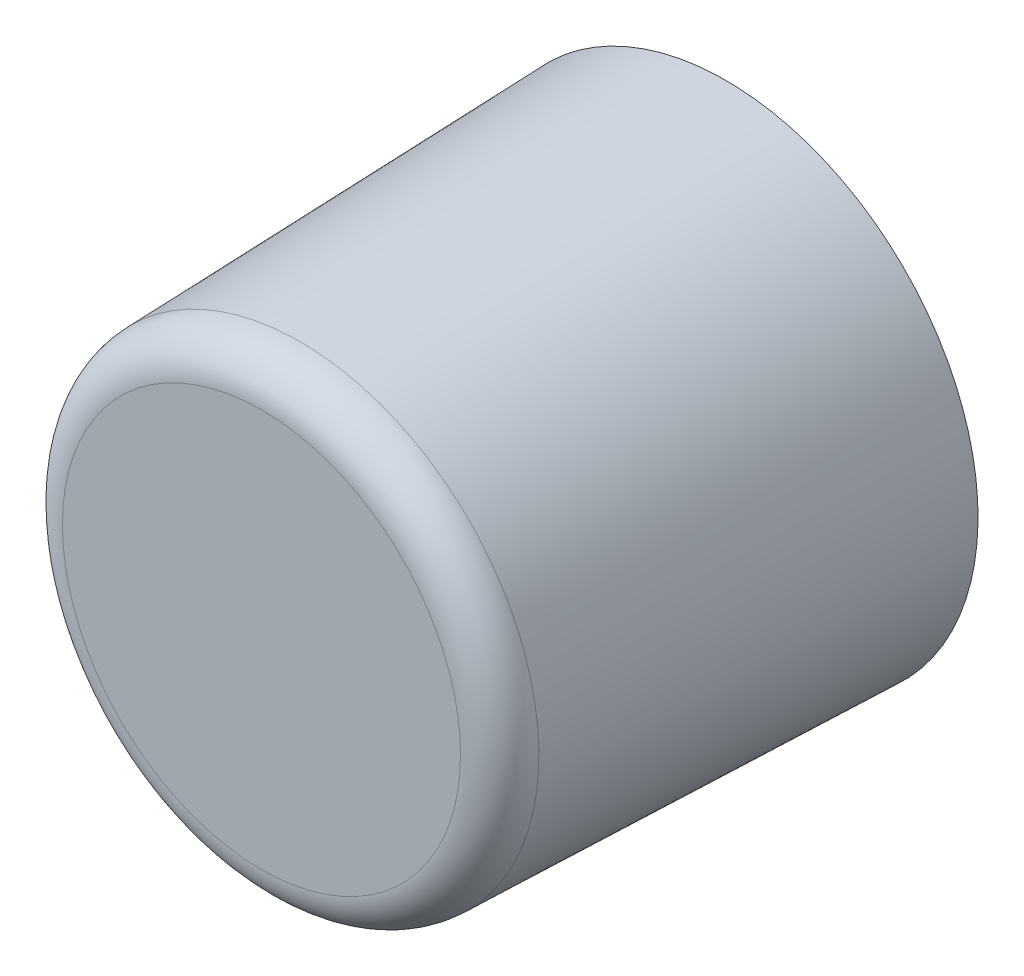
ISO-10303-21;
HEADER;
FILE_DESCRIPTION(('STEP AP214'),'2;1');
FILE_NAME('part.step','',(''),(''),'','','');
FILE_SCHEMA(('AUTOMOTIVE_DESIGN { 1 0 10303 214 1 1 1 1 }'));
ENDSEC;
DATA;
#1=APPLICATION_CONTEXT('core data for automotive mechanical design processes');
#2=APPLICATION_PROTOCOL_DEFINITION('international standard','automotive_design',2000,#1);
#3=PRODUCT_CONTEXT('',#1,'mechanical');
#4=PRODUCT('Part','Part','',(#3));
#5=PRODUCT_RELATED_PRODUCT_CATEGORY('part','',(#4));
#6=PRODUCT_DEFINITION_FORMATION('','',#4);
#7=PRODUCT_DEFINITION_CONTEXT('part definition',#1,'design');
#8=PRODUCT_DEFINITION('design','',#6,#7);
#9=PRODUCT_DEFINITION_SHAPE('','',#8);
#10=(LENGTH_UNIT() NAMED_UNIT(*) SI_UNIT(.MILLI.,.METRE.));
#11=(NAMED_UNIT(*) PLANE_ANGLE_UNIT() SI_UNIT($,.RADIAN.));
#12=(NAMED_UNIT(*) SI_UNIT($,.STERADIAN.) SOLID_ANGLE_UNIT());
#13=UNCERTAINTY_MEASURE_WITH_UNIT(LENGTH_MEASURE(1.E-05),#10,'distance_accuracy_value','');
#14=(GEOMETRIC_REPRESENTATION_CONTEXT(3) GLOBAL_UNCERTAINTY_ASSIGNED_CONTEXT((#13)) GLOBAL_UNIT_ASSIGNED_CONTEXT((#10,
#11,#12)) REPRESENTATION_CONTEXT('',''));
#15=CARTESIAN_POINT('',(0.,0.,0.));
#16=DIRECTION('',(0.,0.,1.));
#17=DIRECTION('',(1.,0.,0.));
#18=AXIS2_PLACEMENT_3D('',#15,#16,#17);
#19=CARTESIAN_POINT('',(0.,0.,35.));
#20=DIRECTION('',(0.,0.,1.));
#21=DIRECTION('',(0.,-1.,0.));
#22=AXIS2_PLACEMENT_3D('',#19,#20,#21);
#23=CYLINDRICAL_SURFACE('',#22,17.1);
#24=CARTESIAN_POINT('',(0.,0.,0.));
#25=DIRECTION('',(0.,0.,1.));
#26=DIRECTION('',(0.,-1.,0.));
#27=AXIS2_PLACEMENT_3D('',#24,#25,#26);
#28=CIRCLE('',#27,17.1);
#29=CARTESIAN_POINT('',(0.,-17.1,0.));
#30=VERTEX_POINT('',#29);
#31=EDGE_CURVE('E8',#30,#30,#28,.T.);
#32=ORIENTED_EDGE('',*,*,#31,.F.);
#33=EDGE_LOOP('',(#32));
#34=FACE_BOUND('',#33,.T.);
#35=CARTESIAN_POINT('',(0.,0.,0.0500000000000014));
#36=DIRECTION('',(0.,0.,1.));
#37=DIRECTION('',(0.,-1.,0.));
#38=AXIS2_PLACEMENT_3D('',#35,#36,#37);
#39=CIRCLE('',#38,17.1);
#40=CARTESIAN_POINT('',(0.,-17.1,0.0500000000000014));
#41=VERTEX_POINT('',#40);
#42=EDGE_CURVE('E34',#41,#41,#39,.T.);
#43=ORIENTED_EDGE('',*,*,#42,.T.);
#44=EDGE_LOOP('',(#43));
#45=FACE_BOUND('',#44,.T.);
#46=ADVANCED_FACE('F12',(#34,#45),#23,.F.);
#47=CARTESIAN_POINT('',(17.1,0.,0.));
#48=DIRECTION('',(0.,0.,1.));
#49=DIRECTION('',(0.,-1.,0.));
#50=AXIS2_PLACEMENT_3D('',#47,#48,#49);
#51=PLANE('',#50);
#52=CARTESIAN_POINT('',(0.,0.,0.));
#53=DIRECTION('',(0.,0.,1.));
#54=DIRECTION('',(0.,-1.,0.));
#55=AXIS2_PLACEMENT_3D('',#52,#53,#54);
#56=CIRCLE('',#55,19.);
#57=CARTESIAN_POINT('',(0.,-19.,0.));
#58=VERTEX_POINT('',#57);
#59=EDGE_CURVE('E18',#58,#58,#56,.T.);
#60=ORIENTED_EDGE('',*,*,#59,.F.);
#61=EDGE_LOOP('',(#60));
#62=FACE_BOUND('',#61,.T.);
#63=ORIENTED_EDGE('',*,*,#31,.T.);
#64=EDGE_LOOP('',(#63));
#65=FACE_BOUND('',#64,.T.);
#66=ADVANCED_FACE('F70',(#62,#65),#51,.F.);
#67=CARTESIAN_POINT('',(0.,0.,0.));
#68=DIRECTION('',(0.,0.,-1.));
#69=DIRECTION('',(0.,1.,0.));
#70=AXIS2_PLACEMENT_3D('',#67,#68,#69);
#71=CONICAL_SURFACE('',#70,19.,0.0311942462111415);
#72=CARTESIAN_POINT('',(0.,0.,32.0935675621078));
#73=DIRECTION('',(0.,0.,1.));
#74=DIRECTION('',(0.,-1.,0.));
#75=AXIS2_PLACEMENT_3D('',#72,#73,#74);
#76=CIRCLE('',#75,17.9985404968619);
#77=CARTESIAN_POINT('',(0.,-17.9985404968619,32.0935675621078));
#78=VERTEX_POINT('',#77);
#79=EDGE_CURVE('E22',#78,#78,#76,.T.);
#80=ORIENTED_EDGE('',*,*,#79,.F.);
#81=EDGE_LOOP('',(#80));
#82=FACE_BOUND('',#81,.T.);
#83=ORIENTED_EDGE('',*,*,#59,.T.);
#84=EDGE_LOOP('',(#83));
#85=FACE_BOUND('',#84,.T.);
#86=ADVANCED_FACE('F75',(#82,#85),#71,.T.);
#87=CARTESIAN_POINT('',(0.,0.,32.));
#88=DIRECTION('',(0.,0.,1.));
#89=DIRECTION('',(0.,-1.,0.));
#90=AXIS2_PLACEMENT_3D('',#87,#88,#89);
#91=TOROIDAL_SURFACE('',#90,15.,3.);
#92=ORIENTED_EDGE('',*,*,#79,.T.);
#93=EDGE_LOOP('',(#92));
#94=FACE_BOUND('',#93,.T.);
#95=CARTESIAN_POINT('',(0.,0.,35.));
#96=DIRECTION('',(0.,0.,1.));
#97=DIRECTION('',(0.,-1.,0.));
#98=AXIS2_PLACEMENT_3D('',#95,#96,#97);
#99=CIRCLE('',#98,15.);
#100=CARTESIAN_POINT('',(0.,-15.,35.));
#101=VERTEX_POINT('',#100);
#102=EDGE_CURVE('E26',#101,#101,#99,.T.);
#103=ORIENTED_EDGE('',*,*,#102,.F.);
#104=EDGE_LOOP('',(#103));
#105=FACE_BOUND('',#104,.T.);
#106=ADVANCED_FACE('F65',(#94,#105),#91,.T.);
#107=CARTESIAN_POINT('',(15.,0.,35.));
#108=DIRECTION('',(0.,0.,-1.));
#109=DIRECTION('',(0.,1.,0.));
#110=AXIS2_PLACEMENT_3D('',#107,#108,#109);
#111=PLANE('',#110);
#112=ORIENTED_EDGE('',*,*,#102,.T.);
#113=EDGE_LOOP('',(#112));
#114=FACE_BOUND('',#113,.T.);
#115=ADVANCED_FACE('F55',(#114),#111,.F.);
#116=CARTESIAN_POINT('',(0.,0.,0.));
#117=DIRECTION('',(0.,0.,1.));
#118=DIRECTION('',(0.,-1.,0.));
#119=AXIS2_PLACEMENT_3D('',#116,#117,#118);
#120=PLANE('',#119);
#121=CARTESIAN_POINT('',(0.,0.,0.));
#122=DIRECTION('',(0.,0.,1.));
#123=DIRECTION('',(0.,-1.,0.));
#124=AXIS2_PLACEMENT_3D('',#121,#122,#123);
#125=CIRCLE('',#124,17.05);
#126=CARTESIAN_POINT('',(0.,-17.05,0.));
#127=VERTEX_POINT('',#126);
#128=EDGE_CURVE('E31',#127,#127,#125,.T.);
#129=ORIENTED_EDGE('',*,*,#128,.F.);
#130=EDGE_LOOP('',(#129));
#131=FACE_BOUND('',#130,.T.);
#132=CARTESIAN_POINT('',(0.,0.,0.));
#133=DIRECTION('',(0.,0.,-1.));
#134=DIRECTION('',(0.,1.,0.));
#135=AXIS2_PLACEMENT_3D('',#132,#133,#134);
#136=CIRCLE('',#135,5.);
#137=CARTESIAN_POINT('',(0.,5.,0.));
#138=VERTEX_POINT('',#137);
#139=EDGE_CURVE('E38',#138,#138,#136,.T.);
#140=ORIENTED_EDGE('',*,*,#139,.F.);
#141=EDGE_LOOP('',(#140));
#142=FACE_BOUND('',#141,.T.);
#143=ADVANCED_FACE('F53',(#131,#142),#120,.F.);
#144=CARTESIAN_POINT('',(0.,0.,0.));
#145=DIRECTION('',(0.,0.,1.));
#146=DIRECTION('',(0.,-1.,0.));
#147=AXIS2_PLACEMENT_3D('',#144,#145,#146);
#148=CONICAL_SURFACE('',#147,17.05,0.785398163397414);
#149=ORIENTED_EDGE('',*,*,#42,.F.);
#150=EDGE_LOOP('',(#149));
#151=FACE_BOUND('',#150,.T.);
#152=ORIENTED_EDGE('',*,*,#128,.T.);
#153=EDGE_LOOP('',(#152));
#154=FACE_BOUND('',#153,.T.);
#155=ADVANCED_FACE('F49',(#151,#154),#148,.T.);
#156=CARTESIAN_POINT('',(0.,0.,10.));
#157=DIRECTION('',(0.,0.,-1.));
#158=DIRECTION('',(0.,1.,0.));
#159=AXIS2_PLACEMENT_3D('',#156,#157,#158);
#160=CYLINDRICAL_SURFACE('',#159,5.);
#161=CARTESIAN_POINT('',(0.,0.,10.));
#162=DIRECTION('',(0.,0.,-1.));
#163=DIRECTION('',(0.,1.,0.));
#164=AXIS2_PLACEMENT_3D('',#161,#162,#163);
#165=CIRCLE('',#164,5.);
#166=CARTESIAN_POINT('',(0.,5.,10.));
#167=VERTEX_POINT('',#166);
#168=EDGE_CURVE('E37',#167,#167,#165,.T.);
#169=ORIENTED_EDGE('',*,*,#168,.F.);
#170=EDGE_LOOP('',(#169));
#171=FACE_BOUND('',#170,.T.);
#172=ORIENTED_EDGE('',*,*,#139,.T.);
#173=EDGE_LOOP('',(#172));
#174=FACE_BOUND('',#173,.T.);
#175=ADVANCED_FACE('F46',(#171,#174),#160,.F.);
#176=CARTESIAN_POINT('',(0.,0.,10.));
#177=DIRECTION('',(0.,0.,-1.));
#178=DIRECTION('',(0.,1.,0.));
#179=AXIS2_PLACEMENT_3D('',#176,#177,#178);
#180=PLANE('',#179);
#181=ORIENTED_EDGE('',*,*,#168,.T.);
#182=EDGE_LOOP('',(#181));
#183=FACE_BOUND('',#182,.T.);
#184=ADVANCED_FACE('F44',(#183),#180,.T.);
#185=CLOSED_SHELL('',(#46,#66,#86,#106,#115,#143,#155,#175,#184));
#186=MANIFOLD_SOLID_BREP('B1',#185);
#187=ADVANCED_BREP_SHAPE_REPRESENTATION('',(#18,#186),#14);
#188=SHAPE_DEFINITION_REPRESENTATION(#9,#187);
ENDSEC;
END-ISO-10303-21;
